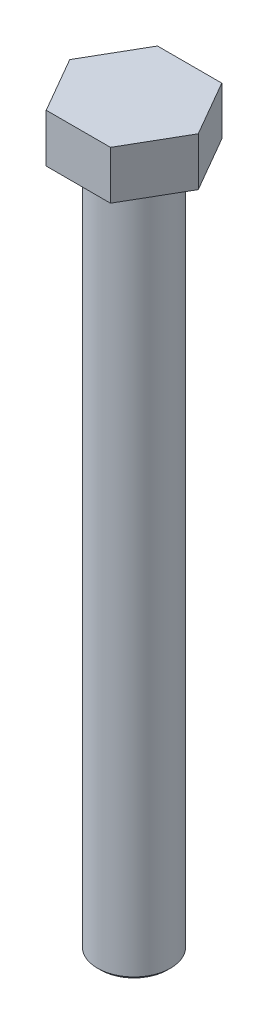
from build123d import *

# Parameters (mm, degrees)
EXTRUDE1_DEPTH = 6.223
SKETCH2_R      = 4.699
EXTRUDE2_DEPTH = 88.9
CHAMFER1_SIZE  = 0.3962


with BuildPart() as part:
    # Sketch1 → Extrude1 (new body)
    with BuildSketch(Plane(origin=(0, 0, 0), x_dir=(1, 0, 0), z_dir=(0, 1, 0))):
        Polygon((8.263556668, 0), (4.131778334, 7.15645), (-4.131778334, 7.15645), (-8.263556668, 0), (-4.131778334, -7.15645), (4.131778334, -7.15645), align=None)
    extrude(amount=-EXTRUDE1_DEPTH)

    # Sketch2 → Extrude2 (add)
    with BuildSketch(Plane.XZ.offset(6.223)):
        with Locations(Location((0, 0, 0), (0, 0, 90))):
            Circle(SKETCH2_R)
    extrude(amount=EXTRUDE2_DEPTH)

    # Chamfer1
    chamfer1_edges = [part.edges().sort_by_distance(p)[0] for p in [
        (0, -95.123, -4.699),
    ]]
    chamfer(chamfer1_edges, length=CHAMFER1_SIZE)


solid = part.part
